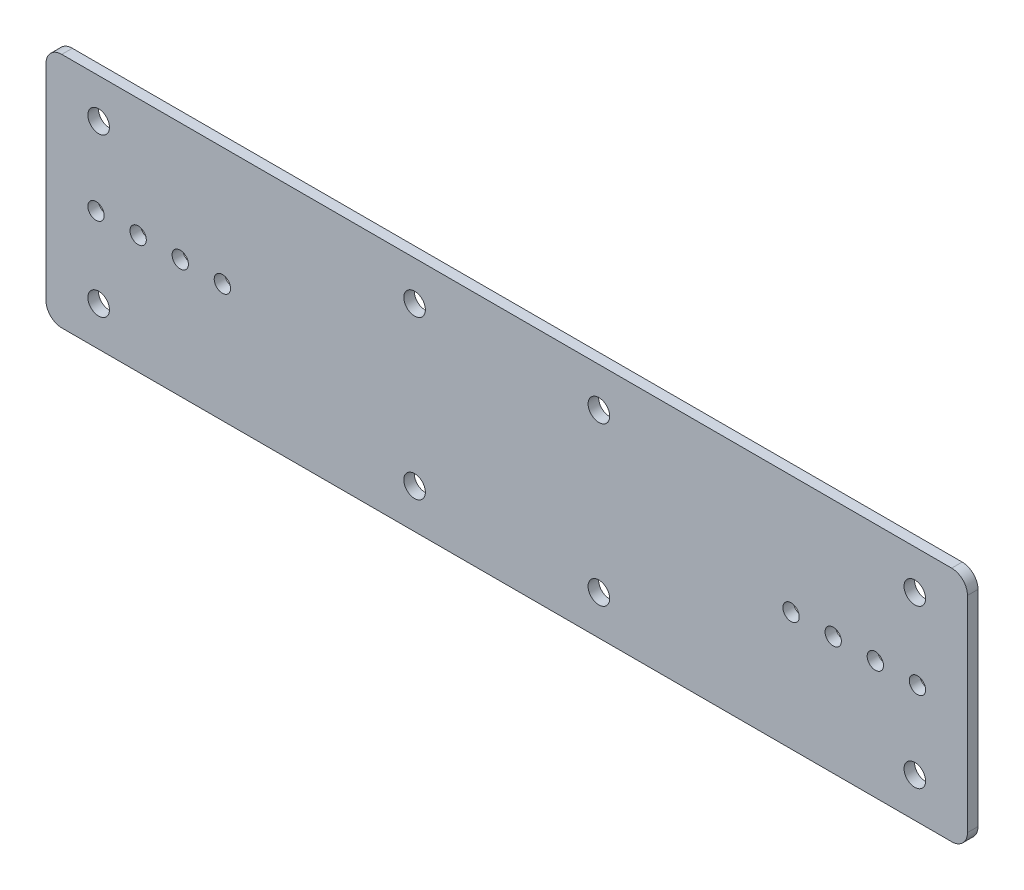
ISO-10303-21;
HEADER;
FILE_DESCRIPTION(('STEP AP214'),'2;1');
FILE_NAME('part.step','',(''),(''),'','','');
FILE_SCHEMA(('AUTOMOTIVE_DESIGN { 1 0 10303 214 1 1 1 1 }'));
ENDSEC;
DATA;
#1=APPLICATION_CONTEXT('core data for automotive mechanical design processes');
#2=APPLICATION_PROTOCOL_DEFINITION('international standard','automotive_design',2000,#1);
#3=PRODUCT_CONTEXT('',#1,'mechanical');
#4=PRODUCT('Part','Part','',(#3));
#5=PRODUCT_RELATED_PRODUCT_CATEGORY('part','',(#4));
#6=PRODUCT_DEFINITION_FORMATION('','',#4);
#7=PRODUCT_DEFINITION_CONTEXT('part definition',#1,'design');
#8=PRODUCT_DEFINITION('design','',#6,#7);
#9=PRODUCT_DEFINITION_SHAPE('','',#8);
#10=(LENGTH_UNIT() NAMED_UNIT(*) SI_UNIT(.MILLI.,.METRE.));
#11=(NAMED_UNIT(*) PLANE_ANGLE_UNIT() SI_UNIT($,.RADIAN.));
#12=(NAMED_UNIT(*) SI_UNIT($,.STERADIAN.) SOLID_ANGLE_UNIT());
#13=UNCERTAINTY_MEASURE_WITH_UNIT(LENGTH_MEASURE(1.E-05),#10,'distance_accuracy_value','');
#14=(GEOMETRIC_REPRESENTATION_CONTEXT(3) GLOBAL_UNCERTAINTY_ASSIGNED_CONTEXT((#13)) GLOBAL_UNIT_ASSIGNED_CONTEXT((#10,
#11,#12)) REPRESENTATION_CONTEXT('',''));
#15=CARTESIAN_POINT('',(0.,0.,0.));
#16=DIRECTION('',(0.,0.,1.));
#17=DIRECTION('',(1.,0.,0.));
#18=AXIS2_PLACEMENT_3D('',#15,#16,#17);
#19=CARTESIAN_POINT('',(0.,0.,2.));
#20=DIRECTION('',(0.,0.,-1.));
#21=DIRECTION('',(-1.,0.,0.));
#22=AXIS2_PLACEMENT_3D('',#19,#20,#21);
#23=PLANE('',#22);
#24=CARTESIAN_POINT('',(-70.,-1.49770552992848E-12,2.));
#25=DIRECTION('',(0.,0.,1.));
#26=DIRECTION('',(1.,0.,0.));
#27=AXIS2_PLACEMENT_3D('',#24,#25,#26);
#28=CIRCLE('',#27,1.54999999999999);
#29=CARTESIAN_POINT('',(-68.45,-1.49770552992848E-12,2.));
#30=VERTEX_POINT('',#29);
#31=EDGE_CURVE('E221',#30,#30,#28,.T.);
#32=ORIENTED_EDGE('',*,*,#31,.F.);
#33=EDGE_LOOP('',(#32));
#34=FACE_BOUND('',#33,.T.);
#35=CARTESIAN_POINT('',(-62.,-1.21285234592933E-12,2.));
#36=DIRECTION('',(0.,0.,1.));
#37=DIRECTION('',(1.,0.,0.));
#38=AXIS2_PLACEMENT_3D('',#35,#36,#37);
#39=CIRCLE('',#38,1.54999999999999);
#40=CARTESIAN_POINT('',(-60.45,-1.21285234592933E-12,2.));
#41=VERTEX_POINT('',#40);
#42=EDGE_CURVE('E569',#41,#41,#39,.T.);
#43=ORIENTED_EDGE('',*,*,#42,.F.);
#44=EDGE_LOOP('',(#43));
#45=FACE_BOUND('',#44,.T.);
#46=CARTESIAN_POINT('',(-54.,-1.04168599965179E-12,2.));
#47=DIRECTION('',(0.,0.,1.));
#48=DIRECTION('',(1.,0.,0.));
#49=AXIS2_PLACEMENT_3D('',#46,#47,#48);
#50=CIRCLE('',#49,1.54999999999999);
#51=CARTESIAN_POINT('',(-52.45,-1.04168599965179E-12,2.));
#52=VERTEX_POINT('',#51);
#53=EDGE_CURVE('E566',#52,#52,#50,.T.);
#54=ORIENTED_EDGE('',*,*,#53,.F.);
#55=EDGE_LOOP('',(#54));
#56=FACE_BOUND('',#55,.T.);
#57=CARTESIAN_POINT('',(54.,1.28228586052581E-12,2.));
#58=DIRECTION('',(0.,0.,1.));
#59=DIRECTION('',(1.,0.,0.));
#60=AXIS2_PLACEMENT_3D('',#57,#58,#59);
#61=CIRCLE('',#60,1.54999999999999);
#62=CARTESIAN_POINT('',(55.55,1.28228586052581E-12,2.));
#63=VERTEX_POINT('',#62);
#64=EDGE_CURVE('E561',#63,#63,#61,.T.);
#65=ORIENTED_EDGE('',*,*,#64,.F.);
#66=EDGE_LOOP('',(#65));
#67=FACE_BOUND('',#66,.T.);
#68=CARTESIAN_POINT('',(62.,1.45541164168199E-12,2.));
#69=DIRECTION('',(0.,0.,1.));
#70=DIRECTION('',(1.,0.,0.));
#71=AXIS2_PLACEMENT_3D('',#68,#69,#70);
#72=CIRCLE('',#71,1.54999999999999);
#73=CARTESIAN_POINT('',(63.55,1.45541164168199E-12,2.));
#74=VERTEX_POINT('',#73);
#75=EDGE_CURVE('E557',#74,#74,#72,.T.);
#76=ORIENTED_EDGE('',*,*,#75,.F.);
#77=EDGE_LOOP('',(#76));
#78=FACE_BOUND('',#77,.T.);
#79=CARTESIAN_POINT('',(70.,1.51485058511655E-12,2.));
#80=DIRECTION('',(0.,0.,1.));
#81=DIRECTION('',(1.,0.,0.));
#82=AXIS2_PLACEMENT_3D('',#79,#80,#81);
#83=CIRCLE('',#82,1.54999999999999);
#84=CARTESIAN_POINT('',(71.55,1.51485058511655E-12,2.));
#85=VERTEX_POINT('',#84);
#86=EDGE_CURVE('E555',#85,#85,#83,.T.);
#87=ORIENTED_EDGE('',*,*,#86,.F.);
#88=EDGE_LOOP('',(#87));
#89=FACE_BOUND('',#88,.T.);
#90=CARTESIAN_POINT('',(78.,1.68797636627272E-12,2.));
#91=DIRECTION('',(0.,0.,1.));
#92=DIRECTION('',(1.,0.,0.));
#93=AXIS2_PLACEMENT_3D('',#90,#91,#92);
#94=CIRCLE('',#93,1.54999999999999);
#95=CARTESIAN_POINT('',(79.55,1.68797636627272E-12,2.));
#96=VERTEX_POINT('',#95);
#97=EDGE_CURVE('E244',#96,#96,#94,.T.);
#98=ORIENTED_EDGE('',*,*,#97,.F.);
#99=EDGE_LOOP('',(#98));
#100=FACE_BOUND('',#99,.T.);
#101=CARTESIAN_POINT('',(-78.,-1.66887187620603E-12,2.));
#102=DIRECTION('',(0.,0.,1.));
#103=DIRECTION('',(1.,0.,0.));
#104=AXIS2_PLACEMENT_3D('',#101,#102,#103);
#105=CIRCLE('',#104,1.54999999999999);
#106=CARTESIAN_POINT('',(-76.45,-1.66887187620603E-12,2.));
#107=VERTEX_POINT('',#106);
#108=EDGE_CURVE('E216',#107,#107,#105,.T.);
#109=ORIENTED_EDGE('',*,*,#108,.F.);
#110=EDGE_LOOP('',(#109));
#111=FACE_BOUND('',#110,.T.);
#112=CARTESIAN_POINT('',(-17.5,15.,2.));
#113=DIRECTION('',(0.,0.,1.));
#114=DIRECTION('',(1.,0.,0.));
#115=AXIS2_PLACEMENT_3D('',#112,#113,#114);
#116=CIRCLE('',#115,2.04999999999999);
#117=CARTESIAN_POINT('',(-15.45,15.,2.));
#118=VERTEX_POINT('',#117);
#119=EDGE_CURVE('E204',#118,#118,#116,.T.);
#120=ORIENTED_EDGE('',*,*,#119,.F.);
#121=EDGE_LOOP('',(#120));
#122=FACE_BOUND('',#121,.T.);
#123=CARTESIAN_POINT('',(17.5,15.,2.));
#124=DIRECTION('',(0.,0.,1.));
#125=DIRECTION('',(1.,0.,0.));
#126=AXIS2_PLACEMENT_3D('',#123,#124,#125);
#127=CIRCLE('',#126,2.04999999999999);
#128=CARTESIAN_POINT('',(19.55,15.,2.));
#129=VERTEX_POINT('',#128);
#130=EDGE_CURVE('E198',#129,#129,#127,.T.);
#131=ORIENTED_EDGE('',*,*,#130,.F.);
#132=EDGE_LOOP('',(#131));
#133=FACE_BOUND('',#132,.T.);
#134=CARTESIAN_POINT('',(17.5000000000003,-15.,2.));
#135=DIRECTION('',(0.,0.,1.));
#136=DIRECTION('',(1.,0.,0.));
#137=AXIS2_PLACEMENT_3D('',#134,#135,#136);
#138=CIRCLE('',#137,2.04999999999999);
#139=CARTESIAN_POINT('',(19.5500000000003,-15.,2.));
#140=VERTEX_POINT('',#139);
#141=EDGE_CURVE('E192',#140,#140,#138,.T.);
#142=ORIENTED_EDGE('',*,*,#141,.F.);
#143=EDGE_LOOP('',(#142));
#144=FACE_BOUND('',#143,.T.);
#145=CARTESIAN_POINT('',(-17.4999999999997,-15.,2.));
#146=DIRECTION('',(0.,0.,1.));
#147=DIRECTION('',(1.,0.,0.));
#148=AXIS2_PLACEMENT_3D('',#145,#146,#147);
#149=CIRCLE('',#148,2.04999999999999);
#150=CARTESIAN_POINT('',(-15.4499999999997,-15.,2.));
#151=VERTEX_POINT('',#150);
#152=EDGE_CURVE('E186',#151,#151,#149,.T.);
#153=ORIENTED_EDGE('',*,*,#152,.F.);
#154=EDGE_LOOP('',(#153));
#155=FACE_BOUND('',#154,.T.);
#156=CARTESIAN_POINT('',(-77.5,14.9999999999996,2.));
#157=DIRECTION('',(0.,0.,1.));
#158=DIRECTION('',(1.,0.,0.));
#159=AXIS2_PLACEMENT_3D('',#156,#157,#158);
#160=CIRCLE('',#159,2.04999999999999);
#161=CARTESIAN_POINT('',(-75.45,14.9999999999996,2.));
#162=VERTEX_POINT('',#161);
#163=EDGE_CURVE('E180',#162,#162,#160,.T.);
#164=ORIENTED_EDGE('',*,*,#163,.F.);
#165=EDGE_LOOP('',(#164));
#166=FACE_BOUND('',#165,.T.);
#167=CARTESIAN_POINT('',(-77.4999999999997,-15.0000000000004,2.));
#168=DIRECTION('',(0.,0.,1.));
#169=DIRECTION('',(1.,0.,0.));
#170=AXIS2_PLACEMENT_3D('',#167,#168,#169);
#171=CIRCLE('',#170,2.04999999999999);
#172=CARTESIAN_POINT('',(-75.4499999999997,-15.0000000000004,2.));
#173=VERTEX_POINT('',#172);
#174=EDGE_CURVE('E174',#173,#173,#171,.T.);
#175=ORIENTED_EDGE('',*,*,#174,.F.);
#176=EDGE_LOOP('',(#175));
#177=FACE_BOUND('',#176,.T.);
#178=CARTESIAN_POINT('',(77.4999999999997,-15.0000000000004,2.));
#179=DIRECTION('',(0.,0.,1.));
#180=DIRECTION('',(-1.,0.,0.));
#181=AXIS2_PLACEMENT_3D('',#178,#179,#180);
#182=CIRCLE('',#181,2.04999999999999);
#183=CARTESIAN_POINT('',(75.4499999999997,-15.0000000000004,2.));
#184=VERTEX_POINT('',#183);
#185=EDGE_CURVE('E168',#184,#184,#182,.T.);
#186=ORIENTED_EDGE('',*,*,#185,.F.);
#187=EDGE_LOOP('',(#186));
#188=FACE_BOUND('',#187,.T.);
#189=CARTESIAN_POINT('',(77.5,14.9999999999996,2.));
#190=DIRECTION('',(0.,0.,1.));
#191=DIRECTION('',(-1.,0.,0.));
#192=AXIS2_PLACEMENT_3D('',#189,#190,#191);
#193=CIRCLE('',#192,2.04999999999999);
#194=CARTESIAN_POINT('',(75.45,14.9999999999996,2.));
#195=VERTEX_POINT('',#194);
#196=EDGE_CURVE('E162',#195,#195,#193,.T.);
#197=ORIENTED_EDGE('',*,*,#196,.F.);
#198=EDGE_LOOP('',(#197));
#199=FACE_BOUND('',#198,.T.);
#200=DIRECTION('',(-1.,0.,0.));
#201=VECTOR('',#200,1.);
#202=CARTESIAN_POINT('',(-160.,22.5,2.));
#203=LINE('',#202,#201);
#204=CARTESIAN_POINT('',(84.5,22.5,2.));
#205=VERTEX_POINT('',#204);
#206=CARTESIAN_POINT('',(-84.5,22.5,2.));
#207=VERTEX_POINT('',#206);
#208=EDGE_CURVE('E104',#205,#207,#203,.T.);
#209=ORIENTED_EDGE('',*,*,#208,.T.);
#210=CARTESIAN_POINT('',(-84.5,19.5,2.));
#211=DIRECTION('',(0.,0.,-1.));
#212=DIRECTION('',(-1.,0.,0.));
#213=AXIS2_PLACEMENT_3D('',#210,#211,#212);
#214=CIRCLE('',#213,3.);
#215=CARTESIAN_POINT('',(-87.5,19.5,2.));
#216=VERTEX_POINT('',#215);
#217=EDGE_CURVE('E134',#207,#216,#214,.F.);
#218=ORIENTED_EDGE('',*,*,#217,.T.);
#219=DIRECTION('',(0.,-1.,0.));
#220=VECTOR('',#219,1.);
#221=CARTESIAN_POINT('',(-87.5,22.5,2.));
#222=LINE('',#221,#220);
#223=CARTESIAN_POINT('',(-87.5,-19.5,2.));
#224=VERTEX_POINT('',#223);
#225=EDGE_CURVE('E158',#216,#224,#222,.T.);
#226=ORIENTED_EDGE('',*,*,#225,.T.);
#227=CARTESIAN_POINT('',(-84.5,-19.5,2.));
#228=DIRECTION('',(0.,0.,-1.));
#229=DIRECTION('',(-1.,0.,0.));
#230=AXIS2_PLACEMENT_3D('',#227,#228,#229);
#231=CIRCLE('',#230,3.);
#232=CARTESIAN_POINT('',(-84.5,-22.5,2.));
#233=VERTEX_POINT('',#232);
#234=EDGE_CURVE('E132',#224,#233,#231,.F.);
#235=ORIENTED_EDGE('',*,*,#234,.T.);
#236=DIRECTION('',(1.,0.,0.));
#237=VECTOR('',#236,1.);
#238=CARTESIAN_POINT('',(-160.,-22.5,2.));
#239=LINE('',#238,#237);
#240=CARTESIAN_POINT('',(84.5,-22.5,2.));
#241=VERTEX_POINT('',#240);
#242=EDGE_CURVE('E120',#233,#241,#239,.T.);
#243=ORIENTED_EDGE('',*,*,#242,.T.);
#244=CARTESIAN_POINT('',(84.5,-19.5,2.));
#245=DIRECTION('',(0.,0.,-1.));
#246=DIRECTION('',(-1.,0.,0.));
#247=AXIS2_PLACEMENT_3D('',#244,#245,#246);
#248=CIRCLE('',#247,3.);
#249=CARTESIAN_POINT('',(87.5,-19.5,2.));
#250=VERTEX_POINT('',#249);
#251=EDGE_CURVE('E111',#241,#250,#248,.F.);
#252=ORIENTED_EDGE('',*,*,#251,.T.);
#253=DIRECTION('',(0.,1.,0.));
#254=VECTOR('',#253,1.);
#255=CARTESIAN_POINT('',(87.5,22.5,2.));
#256=LINE('',#255,#254);
#257=CARTESIAN_POINT('',(87.5,19.5,2.));
#258=VERTEX_POINT('',#257);
#259=EDGE_CURVE('E106',#250,#258,#256,.T.);
#260=ORIENTED_EDGE('',*,*,#259,.T.);
#261=CARTESIAN_POINT('',(84.5,19.5,2.));
#262=DIRECTION('',(0.,0.,-1.));
#263=DIRECTION('',(-1.,0.,0.));
#264=AXIS2_PLACEMENT_3D('',#261,#262,#263);
#265=CIRCLE('',#264,3.);
#266=EDGE_CURVE('E102',#258,#205,#265,.F.);
#267=ORIENTED_EDGE('',*,*,#266,.T.);
#268=EDGE_LOOP('',(#209,#218,#226,#235,#243,#252,#260,#267));
#269=FACE_BOUND('',#268,.T.);
#270=ADVANCED_FACE('F35',(#34,#45,#56,#67,#78,#89,#100,#111,#122,#133,#144,#155,#166,#177,#188,
#199,#269),#23,.F.);
#271=CARTESIAN_POINT('',(0.,0.,0.));
#272=DIRECTION('',(0.,0.,-1.));
#273=DIRECTION('',(-1.,0.,0.));
#274=AXIS2_PLACEMENT_3D('',#271,#272,#273);
#275=PLANE('',#274);
#276=CARTESIAN_POINT('',(-70.,-1.49770552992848E-12,0.));
#277=DIRECTION('',(0.,0.,-1.));
#278=DIRECTION('',(-1.,0.,0.));
#279=AXIS2_PLACEMENT_3D('',#276,#277,#278);
#280=CIRCLE('',#279,1.54999999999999);
#281=CARTESIAN_POINT('',(-71.55,-1.49770552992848E-12,0.));
#282=VERTEX_POINT('',#281);
#283=EDGE_CURVE('E128',#282,#282,#280,.T.);
#284=ORIENTED_EDGE('',*,*,#283,.F.);
#285=EDGE_LOOP('',(#284));
#286=FACE_BOUND('',#285,.T.);
#287=CARTESIAN_POINT('',(-62.,-1.21285234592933E-12,0.));
#288=DIRECTION('',(0.,0.,-1.));
#289=DIRECTION('',(-1.,0.,0.));
#290=AXIS2_PLACEMENT_3D('',#287,#288,#289);
#291=CIRCLE('',#290,1.54999999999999);
#292=CARTESIAN_POINT('',(-63.55,-1.21285234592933E-12,0.));
#293=VERTEX_POINT('',#292);
#294=EDGE_CURVE('E232',#293,#293,#291,.T.);
#295=ORIENTED_EDGE('',*,*,#294,.F.);
#296=EDGE_LOOP('',(#295));
#297=FACE_BOUND('',#296,.T.);
#298=CARTESIAN_POINT('',(-54.,-1.04168599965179E-12,0.));
#299=DIRECTION('',(0.,0.,-1.));
#300=DIRECTION('',(-1.,0.,0.));
#301=AXIS2_PLACEMENT_3D('',#298,#299,#300);
#302=CIRCLE('',#301,1.54999999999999);
#303=CARTESIAN_POINT('',(-55.55,-1.04168599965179E-12,0.));
#304=VERTEX_POINT('',#303);
#305=EDGE_CURVE('E230',#304,#304,#302,.T.);
#306=ORIENTED_EDGE('',*,*,#305,.F.);
#307=EDGE_LOOP('',(#306));
#308=FACE_BOUND('',#307,.T.);
#309=CARTESIAN_POINT('',(54.,1.28228586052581E-12,0.));
#310=DIRECTION('',(0.,0.,-1.));
#311=DIRECTION('',(-1.,0.,0.));
#312=AXIS2_PLACEMENT_3D('',#309,#310,#311);
#313=CIRCLE('',#312,1.54999999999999);
#314=CARTESIAN_POINT('',(52.45,1.28228586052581E-12,0.));
#315=VERTEX_POINT('',#314);
#316=EDGE_CURVE('E227',#315,#315,#313,.T.);
#317=ORIENTED_EDGE('',*,*,#316,.F.);
#318=EDGE_LOOP('',(#317));
#319=FACE_BOUND('',#318,.T.);
#320=CARTESIAN_POINT('',(62.,1.45541164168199E-12,0.));
#321=DIRECTION('',(0.,0.,-1.));
#322=DIRECTION('',(-1.,0.,0.));
#323=AXIS2_PLACEMENT_3D('',#320,#321,#322);
#324=CIRCLE('',#323,1.54999999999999);
#325=CARTESIAN_POINT('',(60.45,1.45541164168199E-12,0.));
#326=VERTEX_POINT('',#325);
#327=EDGE_CURVE('E224',#326,#326,#324,.T.);
#328=ORIENTED_EDGE('',*,*,#327,.F.);
#329=EDGE_LOOP('',(#328));
#330=FACE_BOUND('',#329,.T.);
#331=CARTESIAN_POINT('',(70.,1.51485058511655E-12,0.));
#332=DIRECTION('',(0.,0.,-1.));
#333=DIRECTION('',(-1.,0.,0.));
#334=AXIS2_PLACEMENT_3D('',#331,#332,#333);
#335=CIRCLE('',#334,1.54999999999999);
#336=CARTESIAN_POINT('',(68.45,1.51485058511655E-12,0.));
#337=VERTEX_POINT('',#336);
#338=EDGE_CURVE('E220',#337,#337,#335,.T.);
#339=ORIENTED_EDGE('',*,*,#338,.F.);
#340=EDGE_LOOP('',(#339));
#341=FACE_BOUND('',#340,.T.);
#342=CARTESIAN_POINT('',(78.,1.68797636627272E-12,0.));
#343=DIRECTION('',(0.,0.,-1.));
#344=DIRECTION('',(-1.,0.,0.));
#345=AXIS2_PLACEMENT_3D('',#342,#343,#344);
#346=CIRCLE('',#345,1.54999999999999);
#347=CARTESIAN_POINT('',(76.45,1.68797636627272E-12,0.));
#348=VERTEX_POINT('',#347);
#349=EDGE_CURVE('E217',#348,#348,#346,.T.);
#350=ORIENTED_EDGE('',*,*,#349,.F.);
#351=EDGE_LOOP('',(#350));
#352=FACE_BOUND('',#351,.T.);
#353=CARTESIAN_POINT('',(-78.,-1.66887187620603E-12,0.));
#354=DIRECTION('',(0.,0.,-1.));
#355=DIRECTION('',(-1.,0.,0.));
#356=AXIS2_PLACEMENT_3D('',#353,#354,#355);
#357=CIRCLE('',#356,1.54999999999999);
#358=CARTESIAN_POINT('',(-79.55,-1.66887187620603E-12,0.));
#359=VERTEX_POINT('',#358);
#360=EDGE_CURVE('E213',#359,#359,#357,.T.);
#361=ORIENTED_EDGE('',*,*,#360,.F.);
#362=EDGE_LOOP('',(#361));
#363=FACE_BOUND('',#362,.T.);
#364=CARTESIAN_POINT('',(77.4999999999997,-15.0000000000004,0.));
#365=DIRECTION('',(0.,0.,1.));
#366=DIRECTION('',(-1.,0.,0.));
#367=AXIS2_PLACEMENT_3D('',#364,#365,#366);
#368=CIRCLE('',#367,2.04999999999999);
#369=CARTESIAN_POINT('',(75.4499999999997,-15.0000000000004,0.));
#370=VERTEX_POINT('',#369);
#371=EDGE_CURVE('E165',#370,#370,#368,.T.);
#372=ORIENTED_EDGE('',*,*,#371,.T.);
#373=EDGE_LOOP('',(#372));
#374=FACE_BOUND('',#373,.T.);
#375=CARTESIAN_POINT('',(-77.5,14.9999999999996,0.));
#376=DIRECTION('',(0.,0.,1.));
#377=DIRECTION('',(1.,0.,0.));
#378=AXIS2_PLACEMENT_3D('',#375,#376,#377);
#379=CIRCLE('',#378,2.04999999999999);
#380=CARTESIAN_POINT('',(-75.45,14.9999999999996,0.));
#381=VERTEX_POINT('',#380);
#382=EDGE_CURVE('E177',#381,#381,#379,.T.);
#383=ORIENTED_EDGE('',*,*,#382,.T.);
#384=EDGE_LOOP('',(#383));
#385=FACE_BOUND('',#384,.T.);
#386=CARTESIAN_POINT('',(-17.4999999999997,-15.,0.));
#387=DIRECTION('',(0.,0.,1.));
#388=DIRECTION('',(1.,0.,0.));
#389=AXIS2_PLACEMENT_3D('',#386,#387,#388);
#390=CIRCLE('',#389,2.04999999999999);
#391=CARTESIAN_POINT('',(-15.4499999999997,-15.,0.));
#392=VERTEX_POINT('',#391);
#393=EDGE_CURVE('E183',#392,#392,#390,.T.);
#394=ORIENTED_EDGE('',*,*,#393,.T.);
#395=EDGE_LOOP('',(#394));
#396=FACE_BOUND('',#395,.T.);
#397=CARTESIAN_POINT('',(17.5,15.,0.));
#398=DIRECTION('',(0.,0.,1.));
#399=DIRECTION('',(1.,0.,0.));
#400=AXIS2_PLACEMENT_3D('',#397,#398,#399);
#401=CIRCLE('',#400,2.04999999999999);
#402=CARTESIAN_POINT('',(19.55,15.,0.));
#403=VERTEX_POINT('',#402);
#404=EDGE_CURVE('E195',#403,#403,#401,.T.);
#405=ORIENTED_EDGE('',*,*,#404,.T.);
#406=EDGE_LOOP('',(#405));
#407=FACE_BOUND('',#406,.T.);
#408=CARTESIAN_POINT('',(-17.5,15.,0.));
#409=DIRECTION('',(0.,0.,1.));
#410=DIRECTION('',(1.,0.,0.));
#411=AXIS2_PLACEMENT_3D('',#408,#409,#410);
#412=CIRCLE('',#411,2.04999999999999);
#413=CARTESIAN_POINT('',(-15.45,15.,0.));
#414=VERTEX_POINT('',#413);
#415=EDGE_CURVE('E201',#414,#414,#412,.T.);
#416=ORIENTED_EDGE('',*,*,#415,.T.);
#417=EDGE_LOOP('',(#416));
#418=FACE_BOUND('',#417,.T.);
#419=CARTESIAN_POINT('',(17.5000000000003,-15.,0.));
#420=DIRECTION('',(0.,0.,1.));
#421=DIRECTION('',(1.,0.,0.));
#422=AXIS2_PLACEMENT_3D('',#419,#420,#421);
#423=CIRCLE('',#422,2.04999999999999);
#424=CARTESIAN_POINT('',(19.5500000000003,-15.,0.));
#425=VERTEX_POINT('',#424);
#426=EDGE_CURVE('E189',#425,#425,#423,.T.);
#427=ORIENTED_EDGE('',*,*,#426,.T.);
#428=EDGE_LOOP('',(#427));
#429=FACE_BOUND('',#428,.T.);
#430=CARTESIAN_POINT('',(-77.4999999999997,-15.0000000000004,0.));
#431=DIRECTION('',(0.,0.,1.));
#432=DIRECTION('',(1.,0.,0.));
#433=AXIS2_PLACEMENT_3D('',#430,#431,#432);
#434=CIRCLE('',#433,2.04999999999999);
#435=CARTESIAN_POINT('',(-75.4499999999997,-15.0000000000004,0.));
#436=VERTEX_POINT('',#435);
#437=EDGE_CURVE('E171',#436,#436,#434,.T.);
#438=ORIENTED_EDGE('',*,*,#437,.T.);
#439=EDGE_LOOP('',(#438));
#440=FACE_BOUND('',#439,.T.);
#441=CARTESIAN_POINT('',(77.5,14.9999999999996,0.));
#442=DIRECTION('',(0.,0.,1.));
#443=DIRECTION('',(-1.,0.,0.));
#444=AXIS2_PLACEMENT_3D('',#441,#442,#443);
#445=CIRCLE('',#444,2.04999999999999);
#446=CARTESIAN_POINT('',(75.45,14.9999999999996,0.));
#447=VERTEX_POINT('',#446);
#448=EDGE_CURVE('E156',#447,#447,#445,.T.);
#449=ORIENTED_EDGE('',*,*,#448,.T.);
#450=EDGE_LOOP('',(#449));
#451=FACE_BOUND('',#450,.T.);
#452=DIRECTION('',(0.,1.,0.));
#453=VECTOR('',#452,1.);
#454=CARTESIAN_POINT('',(-87.5,0.,0.));
#455=LINE('',#454,#453);
#456=CARTESIAN_POINT('',(-87.5,-19.5,0.));
#457=VERTEX_POINT('',#456);
#458=CARTESIAN_POINT('',(-87.5,19.5,0.));
#459=VERTEX_POINT('',#458);
#460=EDGE_CURVE('E153',#457,#459,#455,.T.);
#461=ORIENTED_EDGE('',*,*,#460,.T.);
#462=CARTESIAN_POINT('',(-84.5,19.5,0.));
#463=DIRECTION('',(0.,0.,-1.));
#464=DIRECTION('',(-1.,0.,0.));
#465=AXIS2_PLACEMENT_3D('',#462,#463,#464);
#466=CIRCLE('',#465,3.);
#467=CARTESIAN_POINT('',(-84.5,22.5,0.));
#468=VERTEX_POINT('',#467);
#469=EDGE_CURVE('E145',#459,#468,#466,.T.);
#470=ORIENTED_EDGE('',*,*,#469,.T.);
#471=DIRECTION('',(-1.,0.,0.));
#472=VECTOR('',#471,1.);
#473=CARTESIAN_POINT('',(-160.,22.5,0.));
#474=LINE('',#473,#472);
#475=CARTESIAN_POINT('',(84.5,22.5,0.));
#476=VERTEX_POINT('',#475);
#477=EDGE_CURVE('E207',#476,#468,#474,.T.);
#478=ORIENTED_EDGE('',*,*,#477,.F.);
#479=CARTESIAN_POINT('',(84.5,19.5,0.));
#480=DIRECTION('',(0.,0.,-1.));
#481=DIRECTION('',(-1.,0.,0.));
#482=AXIS2_PLACEMENT_3D('',#479,#480,#481);
#483=CIRCLE('',#482,3.);
#484=CARTESIAN_POINT('',(87.5,19.5,0.));
#485=VERTEX_POINT('',#484);
#486=EDGE_CURVE('E57',#476,#485,#483,.T.);
#487=ORIENTED_EDGE('',*,*,#486,.T.);
#488=DIRECTION('',(0.,-1.,0.));
#489=VECTOR('',#488,1.);
#490=CARTESIAN_POINT('',(87.5,0.,0.));
#491=LINE('',#490,#489);
#492=CARTESIAN_POINT('',(87.5,-19.5,0.));
#493=VERTEX_POINT('',#492);
#494=EDGE_CURVE('E152',#485,#493,#491,.T.);
#495=ORIENTED_EDGE('',*,*,#494,.T.);
#496=CARTESIAN_POINT('',(84.5,-19.5,0.));
#497=DIRECTION('',(0.,0.,-1.));
#498=DIRECTION('',(-1.,0.,0.));
#499=AXIS2_PLACEMENT_3D('',#496,#497,#498);
#500=CIRCLE('',#499,3.);
#501=CARTESIAN_POINT('',(84.5,-22.5,0.));
#502=VERTEX_POINT('',#501);
#503=EDGE_CURVE('E50',#493,#502,#500,.T.);
#504=ORIENTED_EDGE('',*,*,#503,.T.);
#505=DIRECTION('',(1.,0.,0.));
#506=VECTOR('',#505,1.);
#507=CARTESIAN_POINT('',(-160.,-22.5,0.));
#508=LINE('',#507,#506);
#509=CARTESIAN_POINT('',(-84.5,-22.5,0.));
#510=VERTEX_POINT('',#509);
#511=EDGE_CURVE('E121',#510,#502,#508,.T.);
#512=ORIENTED_EDGE('',*,*,#511,.F.);
#513=CARTESIAN_POINT('',(-84.5,-19.5,0.));
#514=DIRECTION('',(0.,0.,-1.));
#515=DIRECTION('',(-1.,0.,0.));
#516=AXIS2_PLACEMENT_3D('',#513,#514,#515);
#517=CIRCLE('',#516,3.);
#518=EDGE_CURVE('E143',#510,#457,#517,.T.);
#519=ORIENTED_EDGE('',*,*,#518,.T.);
#520=EDGE_LOOP('',(#461,#470,#478,#487,#495,#504,#512,#519));
#521=FACE_BOUND('',#520,.T.);
#522=ADVANCED_FACE('F257',(#286,#297,#308,#319,#330,#341,#352,#363,#374,#385,#396,#407,#418,
#429,#440,#451,#521),#275,.T.);
#523=CARTESIAN_POINT('',(-160.,22.5,2.));
#524=DIRECTION('',(0.,-1.,0.));
#525=DIRECTION('',(0.,0.,-1.));
#526=AXIS2_PLACEMENT_3D('',#523,#524,#525);
#527=PLANE('',#526);
#528=ORIENTED_EDGE('',*,*,#477,.T.);
#529=DIRECTION('',(0.,0.,1.));
#530=VECTOR('',#529,1.);
#531=CARTESIAN_POINT('',(-84.5,22.5,2.));
#532=LINE('',#531,#530);
#533=EDGE_CURVE('E112',#468,#207,#532,.T.);
#534=ORIENTED_EDGE('',*,*,#533,.T.);
#535=ORIENTED_EDGE('',*,*,#208,.F.);
#536=DIRECTION('',(0.,0.,1.));
#537=VECTOR('',#536,1.);
#538=CARTESIAN_POINT('',(84.5,22.5,0.));
#539=LINE('',#538,#537);
#540=EDGE_CURVE('E118',#205,#476,#539,.F.);
#541=ORIENTED_EDGE('',*,*,#540,.T.);
#542=EDGE_LOOP('',(#528,#534,#535,#541));
#543=FACE_BOUND('',#542,.T.);
#544=ADVANCED_FACE('F117',(#543),#527,.F.);
#545=CARTESIAN_POINT('',(-160.,-22.5,2.));
#546=DIRECTION('',(0.,1.,0.));
#547=DIRECTION('',(-1.,0.,0.));
#548=AXIS2_PLACEMENT_3D('',#545,#546,#547);
#549=PLANE('',#548);
#550=ORIENTED_EDGE('',*,*,#242,.F.);
#551=DIRECTION('',(0.,0.,1.));
#552=VECTOR('',#551,1.);
#553=CARTESIAN_POINT('',(-84.5,-22.5,0.));
#554=LINE('',#553,#552);
#555=EDGE_CURVE('E149',#233,#510,#554,.F.);
#556=ORIENTED_EDGE('',*,*,#555,.T.);
#557=ORIENTED_EDGE('',*,*,#511,.T.);
#558=DIRECTION('',(0.,0.,-1.));
#559=VECTOR('',#558,1.);
#560=CARTESIAN_POINT('',(84.5,-22.5,2.));
#561=LINE('',#560,#559);
#562=EDGE_CURVE('E147',#502,#241,#561,.F.);
#563=ORIENTED_EDGE('',*,*,#562,.T.);
#564=EDGE_LOOP('',(#550,#556,#557,#563));
#565=FACE_BOUND('',#564,.T.);
#566=ADVANCED_FACE('F264',(#565),#549,.F.);
#567=CARTESIAN_POINT('',(-17.5,15.,2.));
#568=DIRECTION('',(0.,0.,-1.));
#569=DIRECTION('',(-1.,0.,0.));
#570=AXIS2_PLACEMENT_3D('',#567,#568,#569);
#571=CYLINDRICAL_SURFACE('',#570,2.04999999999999);
#572=ORIENTED_EDGE('',*,*,#119,.T.);
#573=EDGE_LOOP('',(#572));
#574=FACE_BOUND('',#573,.T.);
#575=ORIENTED_EDGE('',*,*,#415,.F.);
#576=EDGE_LOOP('',(#575));
#577=FACE_BOUND('',#576,.T.);
#578=ADVANCED_FACE('F285',(#574,#577),#571,.F.);
#579=CARTESIAN_POINT('',(17.5,15.,2.));
#580=DIRECTION('',(0.,0.,-1.));
#581=DIRECTION('',(-1.,0.,0.));
#582=AXIS2_PLACEMENT_3D('',#579,#580,#581);
#583=CYLINDRICAL_SURFACE('',#582,2.04999999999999);
#584=ORIENTED_EDGE('',*,*,#130,.T.);
#585=EDGE_LOOP('',(#584));
#586=FACE_BOUND('',#585,.T.);
#587=ORIENTED_EDGE('',*,*,#404,.F.);
#588=EDGE_LOOP('',(#587));
#589=FACE_BOUND('',#588,.T.);
#590=ADVANCED_FACE('F354',(#586,#589),#583,.F.);
#591=CARTESIAN_POINT('',(17.5000000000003,-15.,2.));
#592=DIRECTION('',(0.,0.,-1.));
#593=DIRECTION('',(-1.,0.,0.));
#594=AXIS2_PLACEMENT_3D('',#591,#592,#593);
#595=CYLINDRICAL_SURFACE('',#594,2.04999999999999);
#596=ORIENTED_EDGE('',*,*,#141,.T.);
#597=EDGE_LOOP('',(#596));
#598=FACE_BOUND('',#597,.T.);
#599=ORIENTED_EDGE('',*,*,#426,.F.);
#600=EDGE_LOOP('',(#599));
#601=FACE_BOUND('',#600,.T.);
#602=ADVANCED_FACE('F351',(#598,#601),#595,.F.);
#603=CARTESIAN_POINT('',(-17.4999999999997,-15.,2.));
#604=DIRECTION('',(0.,0.,-1.));
#605=DIRECTION('',(-1.,0.,0.));
#606=AXIS2_PLACEMENT_3D('',#603,#604,#605);
#607=CYLINDRICAL_SURFACE('',#606,2.04999999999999);
#608=ORIENTED_EDGE('',*,*,#152,.T.);
#609=EDGE_LOOP('',(#608));
#610=FACE_BOUND('',#609,.T.);
#611=ORIENTED_EDGE('',*,*,#393,.F.);
#612=EDGE_LOOP('',(#611));
#613=FACE_BOUND('',#612,.T.);
#614=ADVANCED_FACE('F347',(#610,#613),#607,.F.);
#615=CARTESIAN_POINT('',(-77.5,14.9999999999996,2.));
#616=DIRECTION('',(0.,0.,-1.));
#617=DIRECTION('',(-1.,0.,0.));
#618=AXIS2_PLACEMENT_3D('',#615,#616,#617);
#619=CYLINDRICAL_SURFACE('',#618,2.04999999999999);
#620=ORIENTED_EDGE('',*,*,#163,.T.);
#621=EDGE_LOOP('',(#620));
#622=FACE_BOUND('',#621,.T.);
#623=ORIENTED_EDGE('',*,*,#382,.F.);
#624=EDGE_LOOP('',(#623));
#625=FACE_BOUND('',#624,.T.);
#626=ADVANCED_FACE('F343',(#622,#625),#619,.F.);
#627=CARTESIAN_POINT('',(-77.4999999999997,-15.0000000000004,2.));
#628=DIRECTION('',(0.,0.,-1.));
#629=DIRECTION('',(-1.,0.,0.));
#630=AXIS2_PLACEMENT_3D('',#627,#628,#629);
#631=CYLINDRICAL_SURFACE('',#630,2.04999999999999);
#632=ORIENTED_EDGE('',*,*,#174,.T.);
#633=EDGE_LOOP('',(#632));
#634=FACE_BOUND('',#633,.T.);
#635=ORIENTED_EDGE('',*,*,#437,.F.);
#636=EDGE_LOOP('',(#635));
#637=FACE_BOUND('',#636,.T.);
#638=ADVANCED_FACE('F339',(#634,#637),#631,.F.);
#639=CARTESIAN_POINT('',(77.4999999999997,-15.0000000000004,2.));
#640=DIRECTION('',(0.,0.,-1.));
#641=DIRECTION('',(-1.,0.,0.));
#642=AXIS2_PLACEMENT_3D('',#639,#640,#641);
#643=CYLINDRICAL_SURFACE('',#642,2.04999999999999);
#644=ORIENTED_EDGE('',*,*,#185,.T.);
#645=EDGE_LOOP('',(#644));
#646=FACE_BOUND('',#645,.T.);
#647=ORIENTED_EDGE('',*,*,#371,.F.);
#648=EDGE_LOOP('',(#647));
#649=FACE_BOUND('',#648,.T.);
#650=ADVANCED_FACE('F335',(#646,#649),#643,.F.);
#651=CARTESIAN_POINT('',(77.5,14.9999999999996,2.));
#652=DIRECTION('',(0.,0.,-1.));
#653=DIRECTION('',(-1.,0.,0.));
#654=AXIS2_PLACEMENT_3D('',#651,#652,#653);
#655=CYLINDRICAL_SURFACE('',#654,2.04999999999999);
#656=ORIENTED_EDGE('',*,*,#196,.T.);
#657=EDGE_LOOP('',(#656));
#658=FACE_BOUND('',#657,.T.);
#659=ORIENTED_EDGE('',*,*,#448,.F.);
#660=EDGE_LOOP('',(#659));
#661=FACE_BOUND('',#660,.T.);
#662=ADVANCED_FACE('F330',(#658,#661),#655,.F.);
#663=CARTESIAN_POINT('',(87.5,22.5,-8.));
#664=DIRECTION('',(1.,0.,0.));
#665=DIRECTION('',(0.,0.,-1.));
#666=AXIS2_PLACEMENT_3D('',#663,#664,#665);
#667=PLANE('',#666);
#668=ORIENTED_EDGE('',*,*,#259,.F.);
#669=DIRECTION('',(0.,0.,-1.));
#670=VECTOR('',#669,1.);
#671=CARTESIAN_POINT('',(87.5,-19.5,0.));
#672=LINE('',#671,#670);
#673=EDGE_CURVE('E11',#250,#493,#672,.T.);
#674=ORIENTED_EDGE('',*,*,#673,.T.);
#675=ORIENTED_EDGE('',*,*,#494,.F.);
#676=DIRECTION('',(0.,0.,1.));
#677=VECTOR('',#676,1.);
#678=CARTESIAN_POINT('',(87.5,19.5,2.));
#679=LINE('',#678,#677);
#680=EDGE_CURVE('E43',#485,#258,#679,.T.);
#681=ORIENTED_EDGE('',*,*,#680,.T.);
#682=EDGE_LOOP('',(#668,#674,#675,#681));
#683=FACE_BOUND('',#682,.T.);
#684=ADVANCED_FACE('F151',(#683),#667,.T.);
#685=CARTESIAN_POINT('',(-87.5,22.5,-8.));
#686=DIRECTION('',(-1.,0.,0.));
#687=DIRECTION('',(0.,0.,1.));
#688=AXIS2_PLACEMENT_3D('',#685,#686,#687);
#689=PLANE('',#688);
#690=ORIENTED_EDGE('',*,*,#225,.F.);
#691=DIRECTION('',(0.,0.,1.));
#692=VECTOR('',#691,1.);
#693=CARTESIAN_POINT('',(-87.5,19.5,0.));
#694=LINE('',#693,#692);
#695=EDGE_CURVE('E139',#216,#459,#694,.F.);
#696=ORIENTED_EDGE('',*,*,#695,.T.);
#697=ORIENTED_EDGE('',*,*,#460,.F.);
#698=DIRECTION('',(0.,0.,1.));
#699=VECTOR('',#698,1.);
#700=CARTESIAN_POINT('',(-87.5,-19.5,2.));
#701=LINE('',#700,#699);
#702=EDGE_CURVE('E136',#457,#224,#701,.T.);
#703=ORIENTED_EDGE('',*,*,#702,.T.);
#704=EDGE_LOOP('',(#690,#696,#697,#703));
#705=FACE_BOUND('',#704,.T.);
#706=ADVANCED_FACE('F251',(#705),#689,.T.);
#707=CARTESIAN_POINT('',(-78.,-1.66887187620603E-12,-8.));
#708=DIRECTION('',(0.,0.,1.));
#709=DIRECTION('',(1.,0.,0.));
#710=AXIS2_PLACEMENT_3D('',#707,#708,#709);
#711=CYLINDRICAL_SURFACE('',#710,1.54999999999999);
#712=ORIENTED_EDGE('',*,*,#360,.T.);
#713=EDGE_LOOP('',(#712));
#714=FACE_BOUND('',#713,.T.);
#715=ORIENTED_EDGE('',*,*,#108,.T.);
#716=EDGE_LOOP('',(#715));
#717=FACE_BOUND('',#716,.T.);
#718=ADVANCED_FACE('F323',(#714,#717),#711,.F.);
#719=CARTESIAN_POINT('',(78.,1.68797636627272E-12,-8.));
#720=DIRECTION('',(0.,0.,1.));
#721=DIRECTION('',(1.,0.,0.));
#722=AXIS2_PLACEMENT_3D('',#719,#720,#721);
#723=CYLINDRICAL_SURFACE('',#722,1.54999999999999);
#724=ORIENTED_EDGE('',*,*,#349,.T.);
#725=EDGE_LOOP('',(#724));
#726=FACE_BOUND('',#725,.T.);
#727=ORIENTED_EDGE('',*,*,#97,.T.);
#728=EDGE_LOOP('',(#727));
#729=FACE_BOUND('',#728,.T.);
#730=ADVANCED_FACE('F319',(#726,#729),#723,.F.);
#731=CARTESIAN_POINT('',(70.,1.51485058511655E-12,-8.));
#732=DIRECTION('',(0.,0.,1.));
#733=DIRECTION('',(1.,0.,0.));
#734=AXIS2_PLACEMENT_3D('',#731,#732,#733);
#735=CYLINDRICAL_SURFACE('',#734,1.54999999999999);
#736=ORIENTED_EDGE('',*,*,#338,.T.);
#737=EDGE_LOOP('',(#736));
#738=FACE_BOUND('',#737,.T.);
#739=ORIENTED_EDGE('',*,*,#86,.T.);
#740=EDGE_LOOP('',(#739));
#741=FACE_BOUND('',#740,.T.);
#742=ADVANCED_FACE('F315',(#738,#741),#735,.F.);
#743=CARTESIAN_POINT('',(62.,1.45541164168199E-12,-8.));
#744=DIRECTION('',(0.,0.,1.));
#745=DIRECTION('',(1.,0.,0.));
#746=AXIS2_PLACEMENT_3D('',#743,#744,#745);
#747=CYLINDRICAL_SURFACE('',#746,1.54999999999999);
#748=ORIENTED_EDGE('',*,*,#327,.T.);
#749=EDGE_LOOP('',(#748));
#750=FACE_BOUND('',#749,.T.);
#751=ORIENTED_EDGE('',*,*,#75,.T.);
#752=EDGE_LOOP('',(#751));
#753=FACE_BOUND('',#752,.T.);
#754=ADVANCED_FACE('F311',(#750,#753),#747,.F.);
#755=CARTESIAN_POINT('',(54.,1.28228586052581E-12,-8.));
#756=DIRECTION('',(0.,0.,1.));
#757=DIRECTION('',(1.,0.,0.));
#758=AXIS2_PLACEMENT_3D('',#755,#756,#757);
#759=CYLINDRICAL_SURFACE('',#758,1.54999999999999);
#760=ORIENTED_EDGE('',*,*,#316,.T.);
#761=EDGE_LOOP('',(#760));
#762=FACE_BOUND('',#761,.T.);
#763=ORIENTED_EDGE('',*,*,#64,.T.);
#764=EDGE_LOOP('',(#763));
#765=FACE_BOUND('',#764,.T.);
#766=ADVANCED_FACE('F307',(#762,#765),#759,.F.);
#767=CARTESIAN_POINT('',(-54.,-1.04168599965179E-12,-8.));
#768=DIRECTION('',(0.,0.,1.));
#769=DIRECTION('',(1.,0.,0.));
#770=AXIS2_PLACEMENT_3D('',#767,#768,#769);
#771=CYLINDRICAL_SURFACE('',#770,1.54999999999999);
#772=ORIENTED_EDGE('',*,*,#305,.T.);
#773=EDGE_LOOP('',(#772));
#774=FACE_BOUND('',#773,.T.);
#775=ORIENTED_EDGE('',*,*,#53,.T.);
#776=EDGE_LOOP('',(#775));
#777=FACE_BOUND('',#776,.T.);
#778=ADVANCED_FACE('F301',(#774,#777),#771,.F.);
#779=CARTESIAN_POINT('',(-62.,-1.21285234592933E-12,-8.));
#780=DIRECTION('',(0.,0.,1.));
#781=DIRECTION('',(1.,0.,0.));
#782=AXIS2_PLACEMENT_3D('',#779,#780,#781);
#783=CYLINDRICAL_SURFACE('',#782,1.54999999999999);
#784=ORIENTED_EDGE('',*,*,#294,.T.);
#785=EDGE_LOOP('',(#784));
#786=FACE_BOUND('',#785,.T.);
#787=ORIENTED_EDGE('',*,*,#42,.T.);
#788=EDGE_LOOP('',(#787));
#789=FACE_BOUND('',#788,.T.);
#790=ADVANCED_FACE('F297',(#786,#789),#783,.F.);
#791=CARTESIAN_POINT('',(-70.,-1.49770552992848E-12,-8.));
#792=DIRECTION('',(0.,0.,1.));
#793=DIRECTION('',(1.,0.,0.));
#794=AXIS2_PLACEMENT_3D('',#791,#792,#793);
#795=CYLINDRICAL_SURFACE('',#794,1.54999999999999);
#796=ORIENTED_EDGE('',*,*,#283,.T.);
#797=EDGE_LOOP('',(#796));
#798=FACE_BOUND('',#797,.T.);
#799=ORIENTED_EDGE('',*,*,#31,.T.);
#800=EDGE_LOOP('',(#799));
#801=FACE_BOUND('',#800,.T.);
#802=ADVANCED_FACE('F293',(#798,#801),#795,.F.);
#803=CARTESIAN_POINT('',(-84.5,19.5,2.));
#804=DIRECTION('',(0.,0.,-1.));
#805=DIRECTION('',(-1.,0.,0.));
#806=AXIS2_PLACEMENT_3D('',#803,#804,#805);
#807=CYLINDRICAL_SURFACE('',#806,3.);
#808=ORIENTED_EDGE('',*,*,#469,.F.);
#809=ORIENTED_EDGE('',*,*,#695,.F.);
#810=ORIENTED_EDGE('',*,*,#217,.F.);
#811=ORIENTED_EDGE('',*,*,#533,.F.);
#812=EDGE_LOOP('',(#808,#809,#810,#811));
#813=FACE_BOUND('',#812,.T.);
#814=ADVANCED_FACE('F256',(#813),#807,.T.);
#815=CARTESIAN_POINT('',(-84.5,-19.5,-8.));
#816=DIRECTION('',(0.,0.,-1.));
#817=DIRECTION('',(-1.,0.,0.));
#818=AXIS2_PLACEMENT_3D('',#815,#816,#817);
#819=CYLINDRICAL_SURFACE('',#818,3.);
#820=ORIENTED_EDGE('',*,*,#518,.F.);
#821=ORIENTED_EDGE('',*,*,#555,.F.);
#822=ORIENTED_EDGE('',*,*,#234,.F.);
#823=ORIENTED_EDGE('',*,*,#702,.F.);
#824=EDGE_LOOP('',(#820,#821,#822,#823));
#825=FACE_BOUND('',#824,.T.);
#826=ADVANCED_FACE('F261',(#825),#819,.T.);
#827=CARTESIAN_POINT('',(84.5,-19.5,-8.));
#828=DIRECTION('',(0.,0.,1.));
#829=DIRECTION('',(1.,0.,0.));
#830=AXIS2_PLACEMENT_3D('',#827,#828,#829);
#831=CYLINDRICAL_SURFACE('',#830,3.);
#832=ORIENTED_EDGE('',*,*,#251,.F.);
#833=ORIENTED_EDGE('',*,*,#562,.F.);
#834=ORIENTED_EDGE('',*,*,#503,.F.);
#835=ORIENTED_EDGE('',*,*,#673,.F.);
#836=EDGE_LOOP('',(#832,#833,#834,#835));
#837=FACE_BOUND('',#836,.T.);
#838=ADVANCED_FACE('F266',(#837),#831,.T.);
#839=CARTESIAN_POINT('',(84.5,19.5,-8.));
#840=DIRECTION('',(0.,0.,-1.));
#841=DIRECTION('',(-1.,0.,0.));
#842=AXIS2_PLACEMENT_3D('',#839,#840,#841);
#843=CYLINDRICAL_SURFACE('',#842,3.);
#844=ORIENTED_EDGE('',*,*,#486,.F.);
#845=ORIENTED_EDGE('',*,*,#540,.F.);
#846=ORIENTED_EDGE('',*,*,#266,.F.);
#847=ORIENTED_EDGE('',*,*,#680,.F.);
#848=EDGE_LOOP('',(#844,#845,#846,#847));
#849=FACE_BOUND('',#848,.T.);
#850=ADVANCED_FACE('F37',(#849),#843,.T.);
#851=CLOSED_SHELL('',(#270,#522,#544,#566,#578,#590,#602,#614,#626,#638,#650,#662,#684,#706,
#718,#730,#742,#754,#766,#778,#790,#802,#814,#826,#838,#850));
#852=MANIFOLD_SOLID_BREP('B2',#851);
#853=ADVANCED_BREP_SHAPE_REPRESENTATION('',(#18,#852),#14);
#854=SHAPE_DEFINITION_REPRESENTATION(#9,#853);
ENDSEC;
END-ISO-10303-21;
